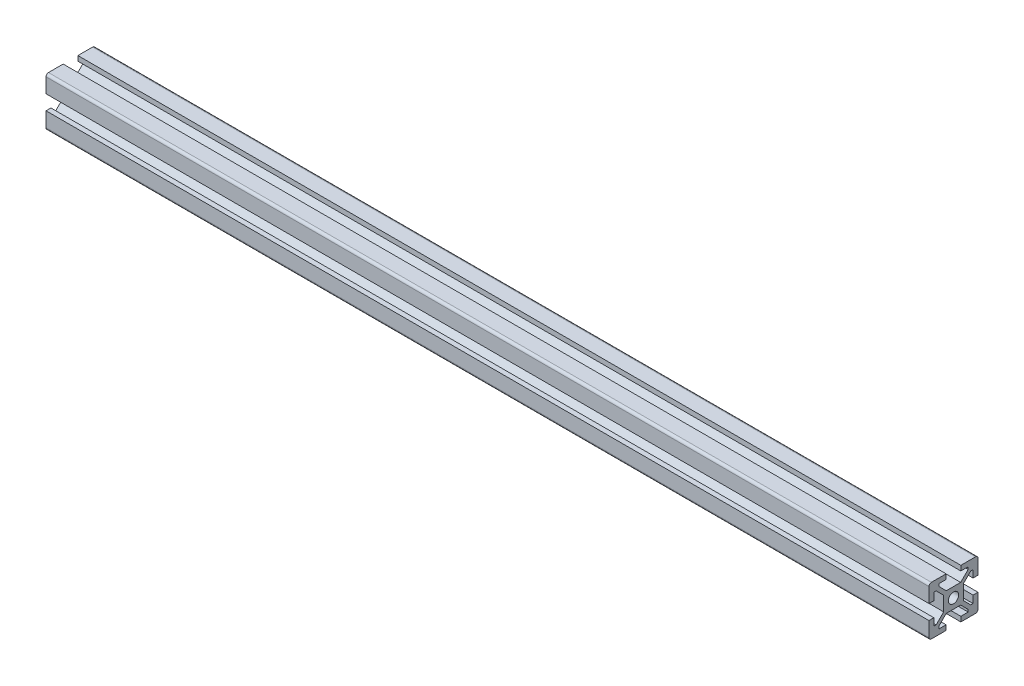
from build123d import *

# Parameters (mm, degrees)
SKETCH1_R           = 2.1
BOSS_EXTRUDE1_DEPTH = 360


with BuildPart() as part:
    # Sketch1 → Boss-Extrude1 (new body)
    with BuildSketch(Plane(origin=(0, 0, 0), x_dir=(0, 0, -1), z_dir=(1, 0, 0))):
        with BuildLine():
            Line((-10, 9), (-10, 3))
            Line((-10, 3), (-8, 3))
            Line((-8, 3), (-8, 6))
            Line((-8, 6), (-7.060660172, 6))
            Line((-7.060660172, 6), (-4, 2.939339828))
            Line((-4, 2.939339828), (-4, -2.939339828))
            Line((-4, -2.939339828), (-7.060660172, -6))
            Line((-7.060660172, -6), (-8, -6))
            Line((-8, -6), (-8, -3))
            Line((-8, -3), (-10, -3))
            Line((-10, -3), (-10, -9))
            ThreePointArc((-10, -9), (-9.707106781, -9.707106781), (-9, -10))
            Line((-9, -10), (-3, -10))
            Line((-3, -10), (-3, -8))
            Line((-3, -8), (-6, -8))
            Line((-6, -8), (-6, -7.060660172))
            Line((-6, -7.060660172), (-2.939339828, -4))
            Line((-2.939339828, -4), (2.939339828, -4))
            Line((2.939339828, -4), (6, -7.060660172))
            Line((6, -7.060660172), (6, -8))
            Line((6, -8), (3, -8))
            Line((3, -8), (3, -10))
            Line((3, -10), (9, -10))
            ThreePointArc((9, -10), (9.707106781, -9.707106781), (10, -9))
            Line((10, -9), (10, -3))
            Line((10, -3), (8, -3))
            Line((8, -3), (8, -6))
            Line((8, -6), (7.060660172, -6))
            Line((7.060660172, -6), (4, -2.939339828))
            Line((4, -2.939339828), (4, 2.939339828))
            Line((4, 2.939339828), (7.060660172, 6))
            Line((7.060660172, 6), (8, 6))
            Line((8, 6), (8, 3))
            Line((8, 3), (10, 3))
            Line((10, 3), (10, 9))
            ThreePointArc((10, 9), (9.707106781, 9.707106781), (9, 10))
            Line((9, 10), (3, 10))
            Line((3, 10), (3, 8))
            Line((3, 8), (6, 8))
            Line((6, 8), (6, 7.060660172))
            Line((6, 7.060660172), (2.939339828, 4))
            Line((2.939339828, 4), (-2.939339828, 4))
            Line((-2.939339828, 4), (-6, 7.060660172))
            Line((-6, 7.060660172), (-6, 8))
            Line((-6, 8), (-3, 8))
            Line((-3, 8), (-3, 10))
            Line((-3, 10), (-9, 10))
            ThreePointArc((-9, 10), (-9.707106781, 9.707106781), (-10, 9))
        make_face()
        with Locations(Location((0, 0, 0), (0, 0, 180))):
            Circle(SKETCH1_R, mode=Mode.SUBTRACT)
    extrude(amount=BOSS_EXTRUDE1_DEPTH)


solid = part.part
